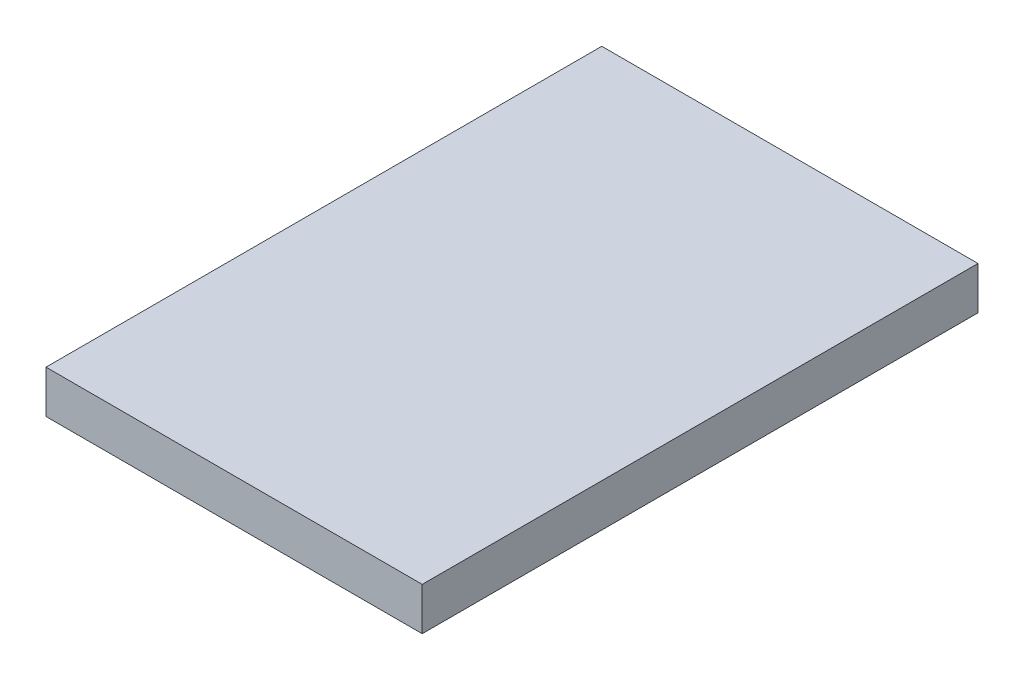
from build123d import *

# Parameters (mm, degrees)
SKETCH1_W      = 88
SKETCH1_H      = 10
EXTRUDE1_DEPTH = 130


with BuildPart() as part:
    # Sketch1 → Extrude1 (new body)
    with BuildSketch(Plane.XY):
        with Locations((0, 5)):
            Rectangle(SKETCH1_W, SKETCH1_H)
    extrude(amount=EXTRUDE1_DEPTH)


solid = part.part
